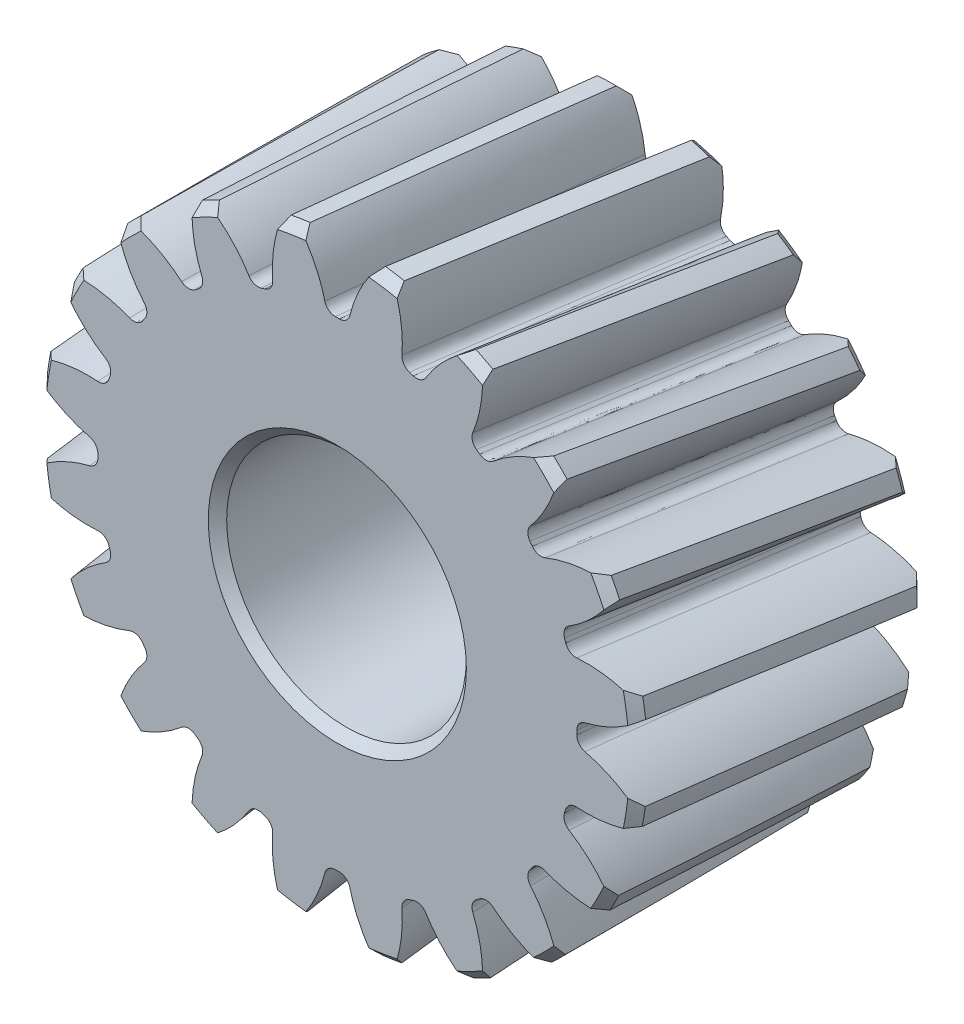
from build123d import *

# Parameters (mm, degrees)
BOSS_EXTRUDE1_DEPTH      = 1.05
BOSS_EXTRUDE1_DEPTH_BACK = 1.05
SKETCH3_R                = 2.2
SKETCH5_W                = 2.1
SKETCH5_H                = 0.875
CHAMFER2_SIZE            = 0.067101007
CUT_SWEEP1_PITCH         = 100
CUT_SWEEP1_HEIGHT        = 5
CUT_SWEEP1_RADIUS        = 2.2
CUT_SWEEP1_START_ANGLE   = -180
FILLET1_R                = 0.078539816
CIRPATTERN1_COUNT        = 20
FILLET1_OF_CIRPATTERN1_R = 0.078539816


with BuildPart() as part:
    # Sketch3 → Boss-Extrude1 (new, two sides: drawn at the far end of the back side and taken through both)
    with BuildSketch(Plane.XY.offset(-BOSS_EXTRUDE1_DEPTH_BACK)):
        Circle(SKETCH3_R)
    extrude(amount=BOSS_EXTRUDE1_DEPTH + BOSS_EXTRUDE1_DEPTH_BACK)

    # Sketch5 → Cut-Revolve1 (revolve, cut)
    with BuildSketch(Plane(origin=(0, 0, 0), x_dir=(0, 0, -1), z_dir=(1, 0, 0)), mode=Mode.PRIVATE) as cut_revolve1_sk:
        with Locations((0, 0.4375)):
            Rectangle(SKETCH5_W, SKETCH5_H)
    revolve(cut_revolve1_sk.sketch.rotate(Axis((0, 0, 1.05), (0, 0, -1)), 90), axis=Axis((0, 0, 1.05), (0, 0, -1)), mode=Mode.SUBTRACT)

    # Chamfer2
    chamfer2_edges = [part.edges().sort_by_distance(p)[0] for p in [
        (-2.2, 0, -1.05),
        (-2.2, 0, 1.05),
        (-0.875, 0, 1.05),
        (-0.875, 0, -1.05),
    ]]
    chamfer(chamfer2_edges, length=CHAMFER2_SIZE)

    # Cut-Sweep1: sweep along a helix
    with BuildLine() as cut_sweep1_path:
        add(Helix(CUT_SWEEP1_PITCH, CUT_SWEEP1_HEIGHT, CUT_SWEEP1_RADIUS, center=(0, 0, 1.05), direction=(0, 0, -1), mode=Mode.PRIVATE).rotate(Axis((0, 0, 1.05), (0, 0, -1)), CUT_SWEEP1_START_ANGLE))
    # Sketch7 → Cut-Sweep1 (sweep, cut)
    with BuildSketch(Plane.XY.offset(1.05)):
        with BuildLine():
            Line((1.748236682, 0.078539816), (1.748236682, -0.078539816))
            ThreePointArc((1.748236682, -0.078539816), (1.977673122, -0.150009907), (2.182699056, -0.275363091))
            ThreePointArc((2.182699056, -0.275363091), (2.2, 0), (2.182699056, 0.275363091))
            ThreePointArc((2.182699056, 0.275363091), (1.977673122, 0.150009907), (1.748236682, 0.078539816))
        make_face()
    cut_sweep1 = sweep(path=cut_sweep1_path.line, is_frenet=True, mode=Mode.SUBTRACT)

    # Fillet1
    fillet1_edges = [part.edges().sort_by_distance(p)[0] for p in [
        (1.74961121, -0.036884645, 4e-09),
        (1.739255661, -0.193622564, 4e-09),
    ]]
    fillet(fillet1_edges, radius=FILLET1_R)

    # CirPattern1: Cut-Sweep1 ×20 about axis
    cirpattern1_axis = Axis((0, 0, -1.05), (0, 0, 1))
    for i in range(1, CIRPATTERN1_COUNT):
        add(cut_sweep1.rotate(cirpattern1_axis, i * 360 / CIRPATTERN1_COUNT), mode=Mode.SUBTRACT)

    # Fillet1 of CirPattern1
    fillet1_of_cirpattern1_edges = [part.edges().sort_by_distance(p)[0] for p in [
        (1.675377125, 0.505580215, 4e-09),
        (1.713963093, 0.353313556, 4e-09),
        (1.437145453, 0.998555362, 4e-09),
        (1.520895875, 0.865664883, 4e-09),
        (1.058235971, 1.393784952, 4e-09),
        (1.178952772, 1.2932789, 4e-09),
        (0.57573898, 1.65258116, 4e-09),
        (0.721605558, 1.594297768, 4e-09),
        (0.036884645, 1.74961121, 4e-09),
        (0.193622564, 1.739255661, 4e-09),
        (-0.505580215, 1.675377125, 4e-09),
        (-0.353313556, 1.713963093, 4e-09),
        (-0.998555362, 1.437145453, 4e-09),
        (-0.865664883, 1.520895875, 4e-09),
        (-1.393784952, 1.058235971, 4e-09),
        (-1.2932789, 1.178952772, 4e-09),
        (-1.65258116, 0.57573898, 4e-09),
        (-1.594297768, 0.721605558, 4e-09),
        (-1.74961121, 0.036884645, 4e-09),
        (-1.739255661, 0.193622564, 4e-09),
        (-1.675377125, -0.505580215, 4e-09),
        (-1.713963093, -0.353313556, 4e-09),
        (-1.437145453, -0.998555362, 4e-09),
        (-1.520895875, -0.865664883, 4e-09),
        (-1.058235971, -1.393784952, 4e-09),
        (-1.178952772, -1.2932789, 4e-09),
        (-0.57573898, -1.65258116, 4e-09),
        (-0.721605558, -1.594297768, 4e-09),
        (-0.036884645, -1.74961121, 4e-09),
        (-0.193622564, -1.739255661, 4e-09),
        (0.505580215, -1.675377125, 4e-09),
        (0.353313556, -1.713963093, 4e-09),
        (0.998555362, -1.437145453, 4e-09),
        (0.865664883, -1.520895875, 4e-09),
        (1.393784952, -1.058235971, 4e-09),
        (1.2932789, -1.178952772, 4e-09),
        (1.65258116, -0.57573898, 4e-09),
        (1.594297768, -0.721605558, 4e-09),
    ]]
    fillet(fillet1_of_cirpattern1_edges, radius=FILLET1_OF_CIRPATTERN1_R)


solid = part.part
